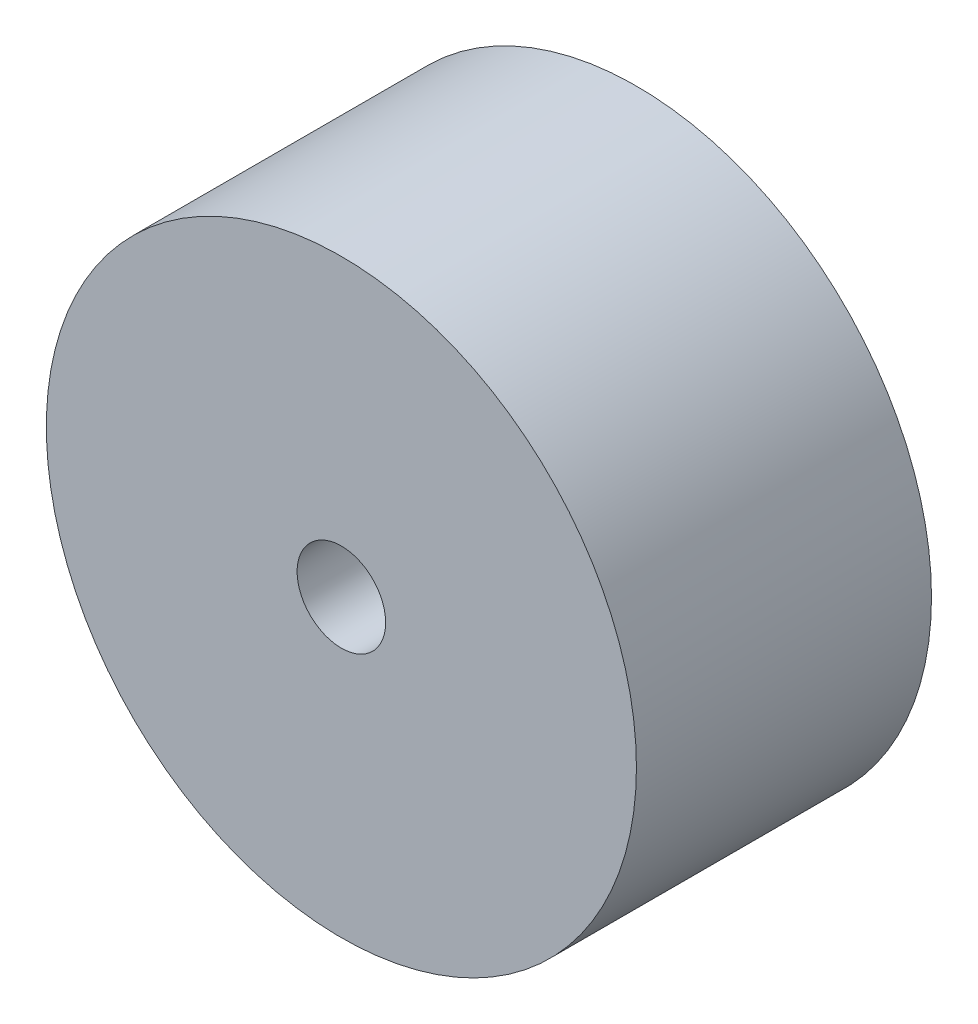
from build123d import *

# Parameters (mm, degrees)
ESQUISSE1_R             = 20
EXTRUSION1_DEPTH        = 20
ESQUISSE4_R             = 3
ENL_V_MAT_EXTRU_1_DEPTH = 7


with BuildPart() as part:
    # Esquisse1 → Extrusion1 (new body)
    with BuildSketch(Plane.XY):
        Circle(ESQUISSE1_R)
    extrude(amount=EXTRUSION1_DEPTH)

    # Esquisse4 → Enl_v. mat.-Extru.1 (cut)
    with BuildSketch(Plane.XY.offset(20)):
        Circle(ESQUISSE4_R)
    extrude(amount=-ENL_V_MAT_EXTRU_1_DEPTH, mode=Mode.SUBTRACT)


solid = part.part
